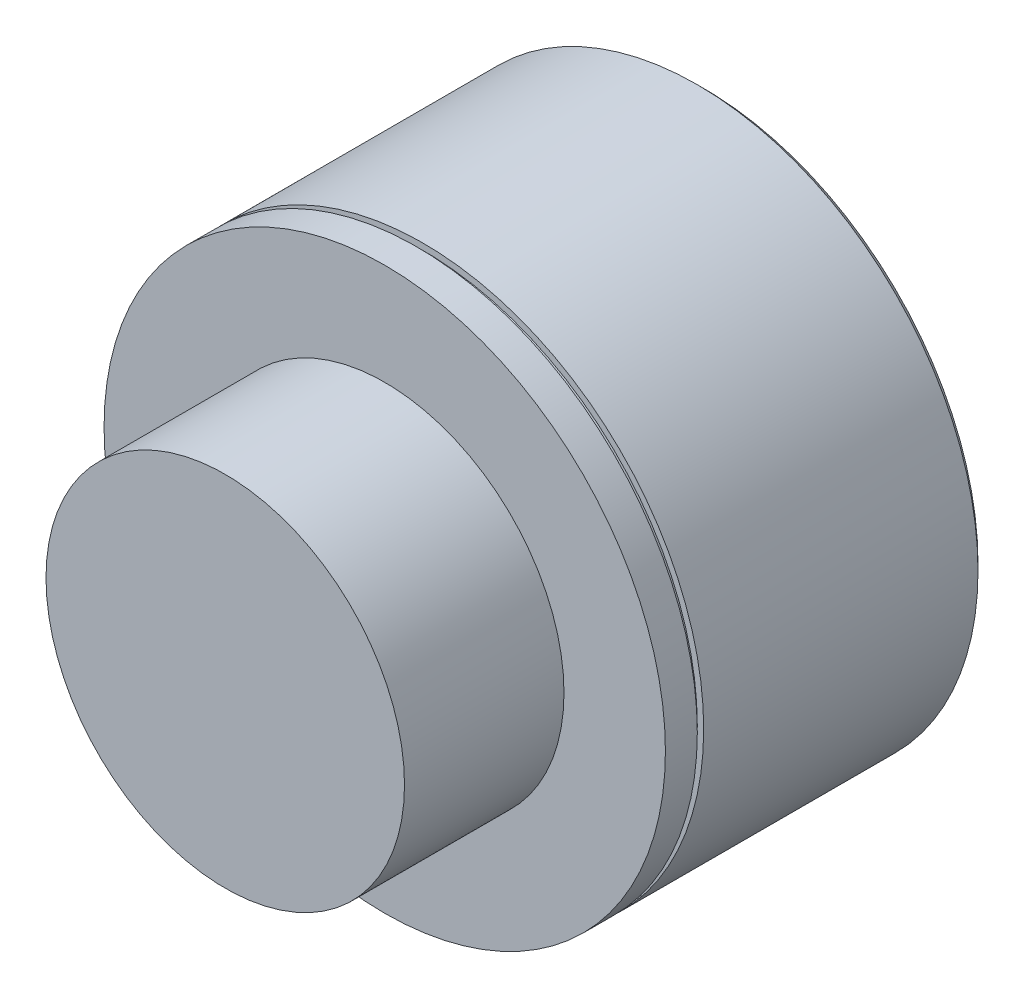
ISO-10303-21;
HEADER;
FILE_DESCRIPTION(('STEP AP214'),'2;1');
FILE_NAME('part.step','',(''),(''),'','','');
FILE_SCHEMA(('AUTOMOTIVE_DESIGN { 1 0 10303 214 1 1 1 1 }'));
ENDSEC;
DATA;
#1=APPLICATION_CONTEXT('core data for automotive mechanical design processes');
#2=APPLICATION_PROTOCOL_DEFINITION('international standard','automotive_design',2000,#1);
#3=PRODUCT_CONTEXT('',#1,'mechanical');
#4=PRODUCT('Part','Part','',(#3));
#5=PRODUCT_RELATED_PRODUCT_CATEGORY('part','',(#4));
#6=PRODUCT_DEFINITION_FORMATION('','',#4);
#7=PRODUCT_DEFINITION_CONTEXT('part definition',#1,'design');
#8=PRODUCT_DEFINITION('design','',#6,#7);
#9=PRODUCT_DEFINITION_SHAPE('','',#8);
#10=(LENGTH_UNIT() NAMED_UNIT(*) SI_UNIT(.MILLI.,.METRE.));
#11=(NAMED_UNIT(*) PLANE_ANGLE_UNIT() SI_UNIT($,.RADIAN.));
#12=(NAMED_UNIT(*) SI_UNIT($,.STERADIAN.) SOLID_ANGLE_UNIT());
#13=UNCERTAINTY_MEASURE_WITH_UNIT(LENGTH_MEASURE(1.E-05),#10,'distance_accuracy_value','');
#14=(GEOMETRIC_REPRESENTATION_CONTEXT(3) GLOBAL_UNCERTAINTY_ASSIGNED_CONTEXT((#13)) GLOBAL_UNIT_ASSIGNED_CONTEXT((#10,
#11,#12)) REPRESENTATION_CONTEXT('',''));
#15=CARTESIAN_POINT('',(0.,0.,0.));
#16=DIRECTION('',(0.,0.,1.));
#17=DIRECTION('',(1.,0.,0.));
#18=AXIS2_PLACEMENT_3D('',#15,#16,#17);
#19=CARTESIAN_POINT('',(0.,0.,-6.35));
#20=DIRECTION('',(0.,0.,1.));
#21=DIRECTION('',(1.,0.,0.));
#22=AXIS2_PLACEMENT_3D('',#19,#20,#21);
#23=CYLINDRICAL_SURFACE('',#22,5.588);
#24=CARTESIAN_POINT('',(0.,0.,0.));
#25=DIRECTION('',(0.,0.,-1.));
#26=DIRECTION('',(-1.,0.,0.));
#27=AXIS2_PLACEMENT_3D('',#24,#25,#26);
#28=CIRCLE('',#27,5.588);
#29=CARTESIAN_POINT('',(-5.588,0.,0.));
#30=VERTEX_POINT('',#29);
#31=EDGE_CURVE('E53',#30,#30,#28,.T.);
#32=ORIENTED_EDGE('',*,*,#31,.T.);
#33=EDGE_LOOP('',(#32));
#34=FACE_BOUND('',#33,.T.);
#35=CARTESIAN_POINT('',(0.,0.,-0.635));
#36=DIRECTION('',(0.,0.,1.));
#37=DIRECTION('',(1.,0.,0.));
#38=AXIS2_PLACEMENT_3D('',#35,#36,#37);
#39=CIRCLE('',#38,5.588);
#40=CARTESIAN_POINT('',(5.588,0.,-0.635));
#41=VERTEX_POINT('',#40);
#42=EDGE_CURVE('E65',#41,#41,#39,.T.);
#43=ORIENTED_EDGE('',*,*,#42,.T.);
#44=EDGE_LOOP('',(#43));
#45=FACE_BOUND('',#44,.T.);
#46=ADVANCED_FACE('F33',(#34,#45),#23,.T.);
#47=CARTESIAN_POINT('',(0.,0.,3.175));
#48=DIRECTION('',(0.,0.,-1.));
#49=DIRECTION('',(-1.,0.,0.));
#50=AXIS2_PLACEMENT_3D('',#47,#48,#49);
#51=CYLINDRICAL_SURFACE('',#50,3.5687);
#52=CARTESIAN_POINT('',(0.,0.,3.175));
#53=DIRECTION('',(0.,0.,1.));
#54=DIRECTION('',(1.,0.,0.));
#55=AXIS2_PLACEMENT_3D('',#52,#53,#54);
#56=CIRCLE('',#55,3.5687);
#57=CARTESIAN_POINT('',(3.5687,0.,3.175));
#58=VERTEX_POINT('',#57);
#59=EDGE_CURVE('E44',#58,#58,#56,.T.);
#60=ORIENTED_EDGE('',*,*,#59,.F.);
#61=EDGE_LOOP('',(#60));
#62=FACE_BOUND('',#61,.T.);
#63=CARTESIAN_POINT('',(0.,0.,0.));
#64=DIRECTION('',(0.,0.,-1.));
#65=DIRECTION('',(-1.,0.,0.));
#66=AXIS2_PLACEMENT_3D('',#63,#64,#65);
#67=CIRCLE('',#66,3.5687);
#68=CARTESIAN_POINT('',(-3.5687,0.,0.));
#69=VERTEX_POINT('',#68);
#70=EDGE_CURVE('E48',#69,#69,#67,.T.);
#71=ORIENTED_EDGE('',*,*,#70,.F.);
#72=EDGE_LOOP('',(#71));
#73=FACE_BOUND('',#72,.T.);
#74=ADVANCED_FACE('F88',(#62,#73),#51,.T.);
#75=CARTESIAN_POINT('',(0.,0.,3.175));
#76=DIRECTION('',(0.,0.,1.));
#77=DIRECTION('',(1.,0.,0.));
#78=AXIS2_PLACEMENT_3D('',#75,#76,#77);
#79=PLANE('',#78);
#80=ORIENTED_EDGE('',*,*,#59,.T.);
#81=EDGE_LOOP('',(#80));
#82=FACE_BOUND('',#81,.T.);
#83=ADVANCED_FACE('F83',(#82),#79,.T.);
#84=CARTESIAN_POINT('',(0.,0.,0.));
#85=DIRECTION('',(0.,0.,-1.));
#86=DIRECTION('',(-1.,0.,0.));
#87=AXIS2_PLACEMENT_3D('',#84,#85,#86);
#88=PLANE('',#87);
#89=ORIENTED_EDGE('',*,*,#70,.T.);
#90=EDGE_LOOP('',(#89));
#91=FACE_BOUND('',#90,.T.);
#92=ORIENTED_EDGE('',*,*,#31,.F.);
#93=EDGE_LOOP('',(#92));
#94=FACE_BOUND('',#93,.T.);
#95=ADVANCED_FACE('F73',(#91,#94),#88,.F.);
#96=CARTESIAN_POINT('',(0.,5.588,-0.635));
#97=DIRECTION('',(0.,0.,-1.));
#98=DIRECTION('',(-1.,0.,0.));
#99=AXIS2_PLACEMENT_3D('',#96,#97,#98);
#100=PLANE('',#99);
#101=CARTESIAN_POINT('',(0.,0.,-0.635));
#102=DIRECTION('',(0.,0.,1.));
#103=DIRECTION('',(1.,0.,0.));
#104=AXIS2_PLACEMENT_3D('',#101,#102,#103);
#105=CIRCLE('',#104,5.461);
#106=CARTESIAN_POINT('',(5.461,0.,-0.635));
#107=VERTEX_POINT('',#106);
#108=EDGE_CURVE('E56',#107,#107,#105,.T.);
#109=ORIENTED_EDGE('',*,*,#108,.T.);
#110=EDGE_LOOP('',(#109));
#111=FACE_BOUND('',#110,.T.);
#112=ORIENTED_EDGE('',*,*,#42,.F.);
#113=EDGE_LOOP('',(#112));
#114=FACE_BOUND('',#113,.T.);
#115=ADVANCED_FACE('F70',(#111,#114),#100,.T.);
#116=CARTESIAN_POINT('',(0.,0.,0.));
#117=DIRECTION('',(0.,0.,1.));
#118=DIRECTION('',(1.,0.,0.));
#119=AXIS2_PLACEMENT_3D('',#116,#117,#118);
#120=CYLINDRICAL_SURFACE('',#119,5.461);
#121=CARTESIAN_POINT('',(0.,0.,-0.762));
#122=DIRECTION('',(0.,0.,1.));
#123=DIRECTION('',(1.,0.,0.));
#124=AXIS2_PLACEMENT_3D('',#121,#122,#123);
#125=CIRCLE('',#124,5.461);
#126=CARTESIAN_POINT('',(5.461,0.,-0.762));
#127=VERTEX_POINT('',#126);
#128=EDGE_CURVE('E59',#127,#127,#125,.T.);
#129=ORIENTED_EDGE('',*,*,#128,.T.);
#130=EDGE_LOOP('',(#129));
#131=FACE_BOUND('',#130,.T.);
#132=ORIENTED_EDGE('',*,*,#108,.F.);
#133=EDGE_LOOP('',(#132));
#134=FACE_BOUND('',#133,.T.);
#135=ADVANCED_FACE('F72',(#131,#134),#120,.T.);
#136=CARTESIAN_POINT('',(0.,5.588,-0.762));
#137=DIRECTION('',(0.,0.,1.));
#138=DIRECTION('',(1.,0.,0.));
#139=AXIS2_PLACEMENT_3D('',#136,#137,#138);
#140=PLANE('',#139);
#141=CARTESIAN_POINT('',(0.,0.,-0.762));
#142=DIRECTION('',(0.,0.,1.));
#143=DIRECTION('',(1.,0.,0.));
#144=AXIS2_PLACEMENT_3D('',#141,#142,#143);
#145=CIRCLE('',#144,5.588);
#146=CARTESIAN_POINT('',(5.588,0.,-0.762));
#147=VERTEX_POINT('',#146);
#148=EDGE_CURVE('E62',#147,#147,#145,.T.);
#149=ORIENTED_EDGE('',*,*,#148,.T.);
#150=EDGE_LOOP('',(#149));
#151=FACE_BOUND('',#150,.T.);
#152=ORIENTED_EDGE('',*,*,#128,.F.);
#153=EDGE_LOOP('',(#152));
#154=FACE_BOUND('',#153,.T.);
#155=ADVANCED_FACE('F80',(#151,#154),#140,.T.);
#156=CARTESIAN_POINT('',(0.,0.,-6.35));
#157=DIRECTION('',(0.,0.,-1.));
#158=DIRECTION('',(-1.,0.,0.));
#159=AXIS2_PLACEMENT_3D('',#156,#157,#158);
#160=PLANE('',#159);
#161=CARTESIAN_POINT('',(0.,0.,-6.35));
#162=DIRECTION('',(0.,0.,-1.));
#163=DIRECTION('',(-1.,0.,0.));
#164=AXIS2_PLACEMENT_3D('',#161,#162,#163);
#165=CIRCLE('',#164,5.461);
#166=CARTESIAN_POINT('',(-5.461,0.,-6.35));
#167=VERTEX_POINT('',#166);
#168=EDGE_CURVE('E40',#167,#167,#165,.T.);
#169=ORIENTED_EDGE('',*,*,#168,.T.);
#170=EDGE_LOOP('',(#169));
#171=FACE_BOUND('',#170,.T.);
#172=ADVANCED_FACE('F101',(#171),#160,.T.);
#173=CARTESIAN_POINT('',(0.,0.,-6.35));
#174=DIRECTION('',(0.,0.,1.));
#175=DIRECTION('',(1.,0.,0.));
#176=AXIS2_PLACEMENT_3D('',#173,#174,#175);
#177=CONICAL_SURFACE('',#176,5.461,0.785398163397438);
#178=CARTESIAN_POINT('',(0.,0.,-6.223));
#179=DIRECTION('',(0.,0.,-1.));
#180=DIRECTION('',(-1.,0.,0.));
#181=AXIS2_PLACEMENT_3D('',#178,#179,#180);
#182=CIRCLE('',#181,5.588);
#183=CARTESIAN_POINT('',(-5.588,0.,-6.223));
#184=VERTEX_POINT('',#183);
#185=EDGE_CURVE('E10',#184,#184,#182,.F.);
#186=ORIENTED_EDGE('',*,*,#185,.F.);
#187=EDGE_LOOP('',(#186));
#188=FACE_BOUND('',#187,.T.);
#189=ORIENTED_EDGE('',*,*,#168,.F.);
#190=EDGE_LOOP('',(#189));
#191=FACE_BOUND('',#190,.T.);
#192=ADVANCED_FACE('F35',(#188,#191),#177,.T.);
#193=ORIENTED_EDGE('',*,*,#185,.T.);
#194=EDGE_LOOP('',(#193));
#195=FACE_BOUND('',#194,.T.);
#196=ORIENTED_EDGE('',*,*,#148,.F.);
#197=EDGE_LOOP('',(#196));
#198=FACE_BOUND('',#197,.T.);
#199=ADVANCED_FACE('F91',(#195,#198),#23,.T.);
#200=CLOSED_SHELL('',(#46,#74,#83,#95,#115,#135,#155,#172,#192,#199));
#201=MANIFOLD_SOLID_BREP('B2',#200);
#202=ADVANCED_BREP_SHAPE_REPRESENTATION('',(#18,#201),#14);
#203=SHAPE_DEFINITION_REPRESENTATION(#9,#202);
ENDSEC;
END-ISO-10303-21;
